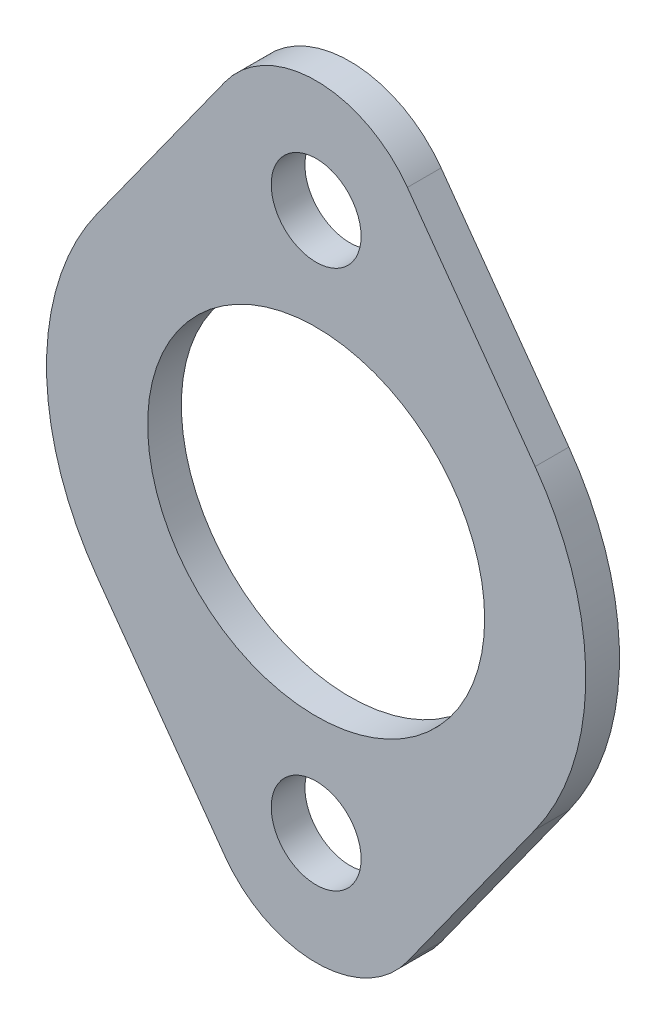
from build123d import *

# Parameters (mm, degrees)
MAIN_DEPTH  = 4.7625
SKETCH2_R   = 6.35
SKETCH2_R_2 = 23.8125
HOLES_DEPTH = 67.238901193


with BuildPart() as part:
    # Sketch1 → Main (new body)
    with BuildSketch(Plane.XY):
        with BuildLine():
            Line((12.894196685, 47.360416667), (30.946072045, 22.225))
            ThreePointArc((30.946072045, 22.225), (38.1, 0), (30.946072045, -22.225))
            Line((30.946072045, -22.225), (12.894196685, -47.360416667))
            ThreePointArc((12.894196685, -47.360416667), (0, -53.975), (-12.894196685, -47.360416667))
            Line((-12.894196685, -47.360416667), (-30.946072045, -22.225))
            ThreePointArc((-30.946072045, -22.225), (-38.1, 0), (-30.946072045, 22.225))
            Line((-30.946072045, 22.225), (-12.894196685, 47.360416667))
            ThreePointArc((-12.894196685, 47.360416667), (0, 53.975), (12.894196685, 47.360416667))
        make_face()
    extrude(amount=MAIN_DEPTH)

    # Sketch2 → Holes (cut, through all)
    with BuildSketch(Plane.XY.offset(4.7625)):
        with Locations((0, 38.1)):
            Circle(SKETCH2_R)
        with Locations((0, -38.1)):
            Circle(SKETCH2_R)
        Circle(SKETCH2_R_2)
    extrude(amount=-HOLES_DEPTH, mode=Mode.SUBTRACT)


solid = part.part
